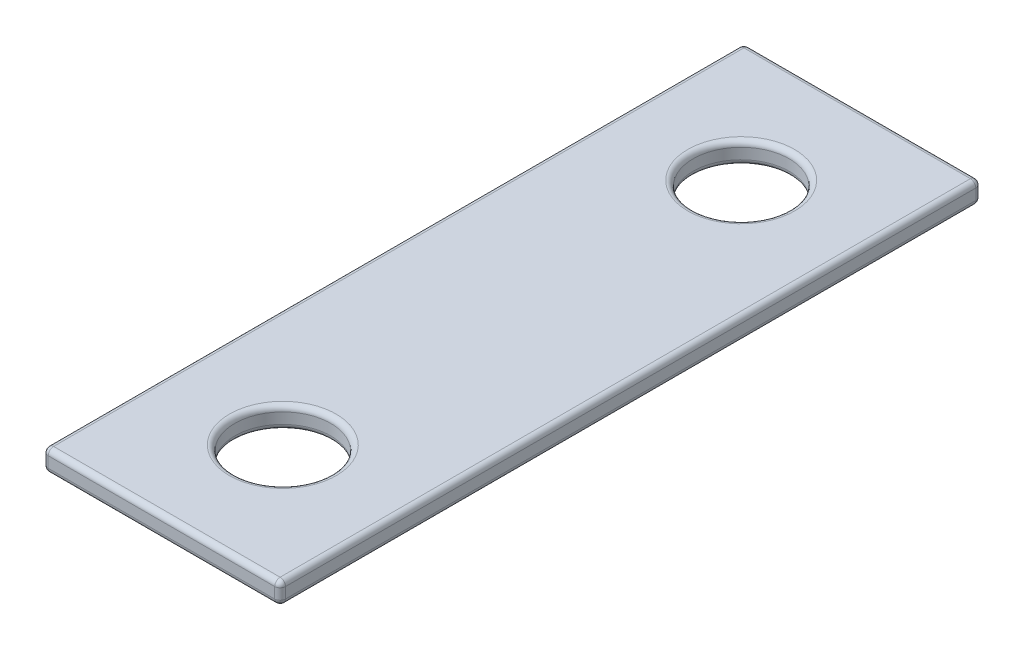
from build123d import *

# Parameters (mm, degrees)
SKETCH1_W           = 5.588
SKETCH1_H           = 16.51
SKETCH1_R           = 1.1303
BOSS_EXTRUDE1_DEPTH = 0.508
FILLET1_R           = 0.127


with BuildPart() as part:
    # Sketch1 → Boss-Extrude1 (new body)
    with BuildSketch(Plane(origin=(0, 0, 0), x_dir=(1, 0, 0), z_dir=(0, 1, 0))):
        with Locations((-3.929784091, -0.598920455)):
            Rectangle(SKETCH1_W, SKETCH1_H)
        with Locations(Location((-3.929784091, 4.798579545, 0), (0, 0, 270))):
            Circle(SKETCH1_R, mode=Mode.SUBTRACT)
        with Locations(Location((-3.929784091, -5.996420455, 0), (0, 0, 270))):
            Circle(SKETCH1_R, mode=Mode.SUBTRACT)
    extrude(amount=BOSS_EXTRUDE1_DEPTH)

    # Fillet1
    fillet1_edges = [part.edges().sort_by_distance(p)[0] for p in [
        (-1.135784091, 0.508, 0.598920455),
        (-3.929784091, 0, -5.928879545),
        (-3.929784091, 0.508, -5.928879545),
        (-3.929784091, 0.508, -7.656079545),
        (-3.929784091, 0, 4.866120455),
        (-3.929784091, 0.508, 4.866120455),
        (-6.723784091, 0.508, 0.598920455),
        (-3.929784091, 0, -7.656079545),
        (-1.135784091, 0, 0.598920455),
        (-3.929784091, 0, 8.853920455),
        (-6.723784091, 0, 0.598920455),
        (-3.929784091, 0.508, 8.853920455),
        (-6.723784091, 0.254, -7.656079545),
        (-1.135784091, 0.254, -7.656079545),
        (-1.135784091, 0.254, 8.853920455),
        (-6.723784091, 0.254, 8.853920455),
    ]]
    fillet(fillet1_edges, radius=FILLET1_R)


solid = part.part
